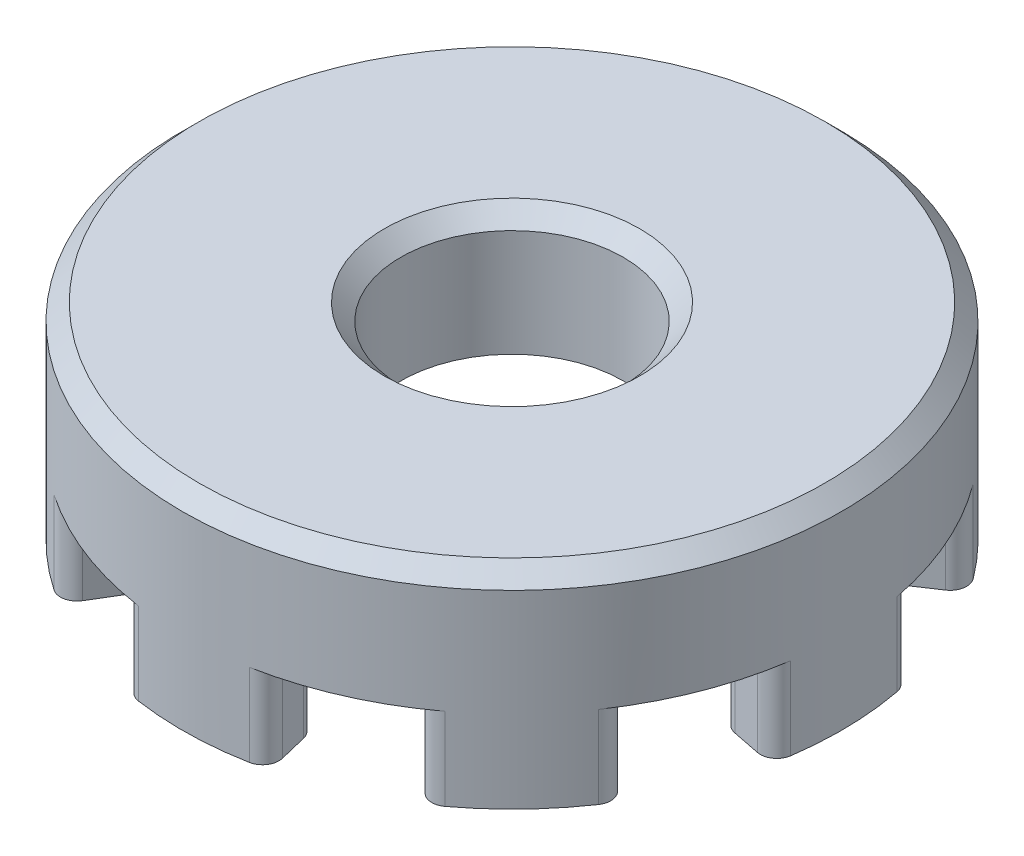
from build123d import *

# Parameters (mm, degrees)
SKETCH1_R           = 8
SKETCH1_R_2         = 6.5
SKETCH1_R_3         = 2.7
BOSS_EXTRUDE1_DEPTH = 3
BOSS_EXTRUDE2_START = -2
SKETCH1_3_R         = 8
SKETCH1_3_R_2       = 6.5
BOSS_EXTRUDE2_DEPTH = 2
CUT_EXTRUDE1_DEPTH  = 2
CIRPATTERN1_COUNT   = 8
FILLET2_R           = 0.4
CHAMFER1_SIZE       = 0.4


with BuildPart() as part:
    # Sketch1 → Boss-Extrude1 (new body)
    # profile 1 of 2: a face of its own
    with BuildSketch(Plane(origin=(0, 0, 0), x_dir=(1, 0, 0), z_dir=(0, 1, 0))):
        with Locations(Location((0, 0, 0), (0, 0, 270))):
            Circle(SKETCH1_R)
        Circle(SKETCH1_R_2, mode=Mode.SUBTRACT)
    # profile 2 of 2: a face of its own
    with BuildSketch(Plane(origin=(0, 0, 0), x_dir=(1, 0, 0), z_dir=(0, 1, 0))):
        Circle(SKETCH1_R_2)
        with Locations(Location((0, 0, 0), (0, 0, 270))):
            Circle(SKETCH1_R_3, mode=Mode.SUBTRACT)
    extrude(amount=BOSS_EXTRUDE1_DEPTH)

    # Sketch1_3 → Boss-Extrude2 (add)
    with BuildSketch(Plane(origin=(0, 0, 0), x_dir=(1, 0, 0), z_dir=(0, 1, 0)).offset(BOSS_EXTRUDE2_START)):
        with Locations(Location((0, 0, 0), (0, 0, 270))):
            Circle(SKETCH1_3_R)
        with Locations(Location((0, 0, 0), (0, 0, 270))):
            Circle(SKETCH1_3_R_2, mode=Mode.SUBTRACT)
    extrude(amount=BOSS_EXTRUDE2_DEPTH)

    # Sketch2 → Cut-Extrude1 (cut)
    with BuildSketch(Plane(origin=(0, -2, 0), x_dir=(-1, 0, 0), z_dir=(0, -1, 0))):
        Polygon((0, 0), (4.153844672, -6.837073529), (4.153844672, -7.845446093), (1.564920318, -7.845446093), align=None)
    cut_extrude1 = extrude(amount=-CUT_EXTRUDE1_DEPTH, mode=Mode.SUBTRACT)

    # CirPattern1: Cut-Extrude1 ×8 about axis
    cirpattern1_axis = Axis((0, 0, 0), (0, 1, 0))
    for i in range(1, CIRPATTERN1_COUNT):
        add(cut_extrude1.rotate(cirpattern1_axis, i * 360 / CIRPATTERN1_COUNT), mode=Mode.SUBTRACT)

    # Fillet2
    fillet2_edges = [part.edges().sort_by_distance(p)[0] for p in [
        (1.271497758, -1, -6.374424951),
        (1.564920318, -1, -7.845446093),
        (3.374998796, -1, -5.555122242),
        (4.153844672, -1, -6.837073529),
        (-3.608314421, -1, -5.406483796),
        (-4.441002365, -1, -6.654133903),
        (-1.541580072, -1, -6.314549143),
        (-1.89732932, -1, -7.771752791),
        (-6.374424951, -1, -1.271497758),
        (-7.845446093, -1, -1.564920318),
        (-5.555122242, -1, -3.374998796),
        (-6.837073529, -1, -4.153844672),
        (-5.406483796, -1, 3.608314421),
        (-6.654133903, -1, 4.441002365),
        (-6.314549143, -1, 1.541580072),
        (-7.771752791, -1, 1.89732932),
        (-1.271497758, -1, 6.374424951),
        (-1.564920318, -1, 7.845446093),
        (-3.374998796, -1, 5.555122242),
        (-4.153844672, -1, 6.837073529),
        (3.608314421, -1, 5.406483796),
        (4.441002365, -1, 6.654133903),
        (1.541580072, -1, 6.314549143),
        (1.89732932, -1, 7.771752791),
        (6.374424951, -1, 1.271497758),
        (7.845446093, -1, 1.564920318),
        (5.555122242, -1, 3.374998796),
        (6.837073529, -1, 4.153844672),
        (5.406483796, -1, -3.608314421),
        (6.654133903, -1, -4.441002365),
        (6.314549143, -1, -1.541580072),
        (7.771752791, -1, -1.89732932),
    ]]
    fillet(fillet2_edges, radius=FILLET2_R)

    # Chamfer1
    chamfer1_edges = [part.edges().sort_by_distance(p)[0] for p in [
        (0, 3, -8),
        (0, 3, -2.7),
    ]]
    chamfer(chamfer1_edges, length=CHAMFER1_SIZE)


solid = part.part
